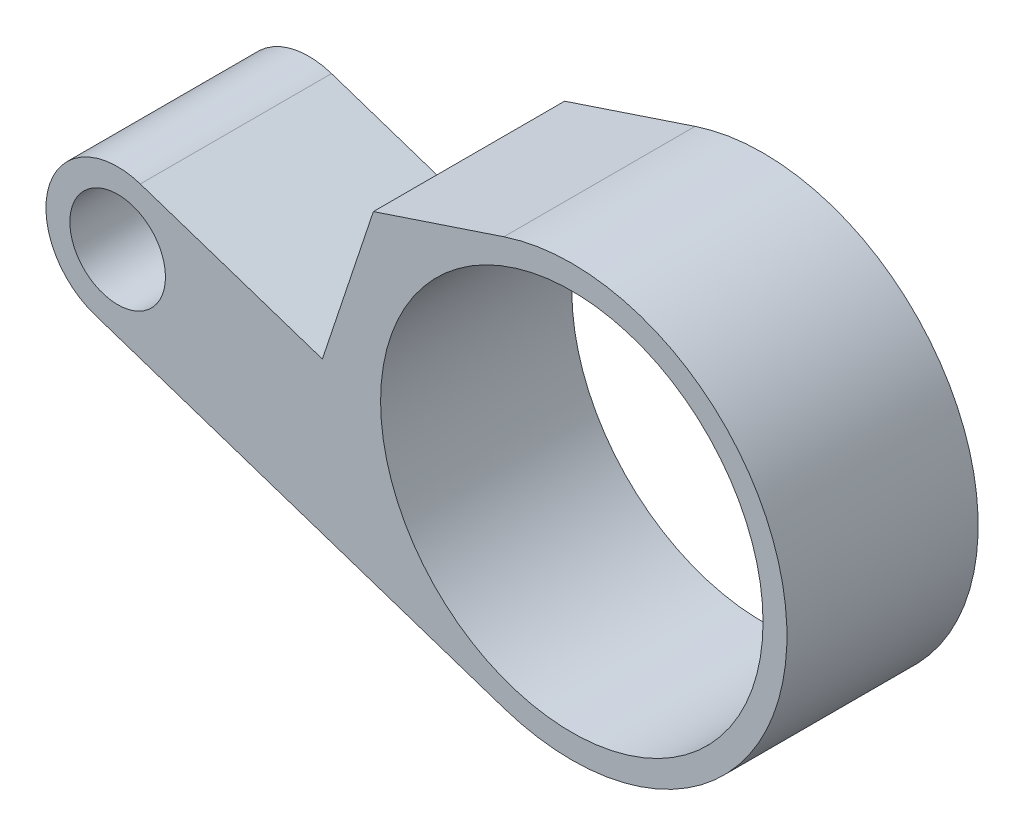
from build123d import *

# Parameters (mm, degrees)
SKETCH1_R           = 25.4
SKETCH1_R_2         = 6.35
BOSS_EXTRUDE1_DEPTH = 25.4


with BuildPart() as part:
    # Sketch1 → Boss-Extrude1 (new body)
    with BuildSketch(Plane.XY):
        with BuildLine():
            Line((-26.358802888, 21.343320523), (-9.023684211, 27.112796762))
            ThreePointArc((-9.023684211, 27.112796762), (28.575, 0), (-9.023684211, -27.112796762))
            Line((-9.023684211, -27.112796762), (-63.332894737, -9.037598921))
            ThreePointArc((-63.332894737, -9.037598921), (-69.362598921, 3.007894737), (-57.317105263, 9.037598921))
            Line((-57.317105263, 9.037598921), (-33.133224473, 0.988716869))
            Line((-33.133224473, 0.988716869), (-26.358802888, 21.343320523))
        make_face()
        Circle(SKETCH1_R, mode=Mode.SUBTRACT)
        with Locations((-60.325, 0)):
            Circle(SKETCH1_R_2, mode=Mode.SUBTRACT)
    extrude(amount=BOSS_EXTRUDE1_DEPTH)


solid = part.part
